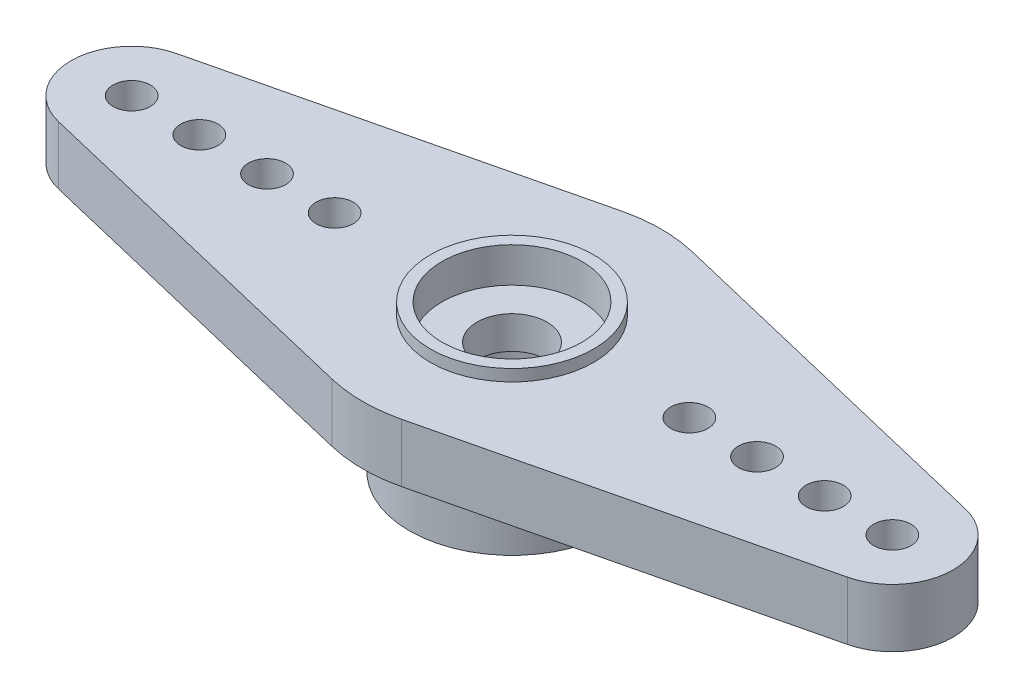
ISO-10303-21;
HEADER;
FILE_DESCRIPTION(('STEP AP214'),'2;1');
FILE_NAME('part.step','',(''),(''),'','','');
FILE_SCHEMA(('AUTOMOTIVE_DESIGN { 1 0 10303 214 1 1 1 1 }'));
ENDSEC;
DATA;
#1=APPLICATION_CONTEXT('core data for automotive mechanical design processes');
#2=APPLICATION_PROTOCOL_DEFINITION('international standard','automotive_design',2000,#1);
#3=PRODUCT_CONTEXT('',#1,'mechanical');
#4=PRODUCT('Part','Part','',(#3));
#5=PRODUCT_RELATED_PRODUCT_CATEGORY('part','',(#4));
#6=PRODUCT_DEFINITION_FORMATION('','',#4);
#7=PRODUCT_DEFINITION_CONTEXT('part definition',#1,'design');
#8=PRODUCT_DEFINITION('design','',#6,#7);
#9=PRODUCT_DEFINITION_SHAPE('','',#8);
#10=(LENGTH_UNIT() NAMED_UNIT(*) SI_UNIT(.MILLI.,.METRE.));
#11=(NAMED_UNIT(*) PLANE_ANGLE_UNIT() SI_UNIT($,.RADIAN.));
#12=(NAMED_UNIT(*) SI_UNIT($,.STERADIAN.) SOLID_ANGLE_UNIT());
#13=UNCERTAINTY_MEASURE_WITH_UNIT(LENGTH_MEASURE(1.E-05),#10,'distance_accuracy_value','');
#14=(GEOMETRIC_REPRESENTATION_CONTEXT(3) GLOBAL_UNCERTAINTY_ASSIGNED_CONTEXT((#13)) GLOBAL_UNIT_ASSIGNED_CONTEXT((#10,
#11,#12)) REPRESENTATION_CONTEXT('',''));
#15=CARTESIAN_POINT('',(0.,0.,0.));
#16=DIRECTION('',(0.,0.,1.));
#17=DIRECTION('',(1.,0.,0.));
#18=AXIS2_PLACEMENT_3D('',#15,#16,#17);
#19=CARTESIAN_POINT('',(0.,2.5,0.));
#20=DIRECTION('',(0.,-1.,0.));
#21=DIRECTION('',(0.,0.,-1.));
#22=AXIS2_PLACEMENT_3D('',#19,#20,#21);
#23=CYLINDRICAL_SURFACE('',#22,1.5);
#24=CARTESIAN_POINT('',(0.,0.0999999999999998,0.));
#25=DIRECTION('',(0.,-1.,0.));
#26=DIRECTION('',(0.,0.,-1.));
#27=AXIS2_PLACEMENT_3D('',#24,#25,#26);
#28=CIRCLE('',#27,1.5);
#29=CARTESIAN_POINT('',(0.,0.0999999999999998,-1.5));
#30=VERTEX_POINT('',#29);
#31=EDGE_CURVE('E39',#30,#30,#28,.T.);
#32=ORIENTED_EDGE('',*,*,#31,.T.);
#33=EDGE_LOOP('',(#32));
#34=FACE_BOUND('',#33,.T.);
#35=CARTESIAN_POINT('',(0.,1.5,0.));
#36=DIRECTION('',(0.,1.,0.));
#37=DIRECTION('',(0.,0.,1.));
#38=AXIS2_PLACEMENT_3D('',#35,#36,#37);
#39=CIRCLE('',#38,1.5);
#40=CARTESIAN_POINT('',(0.,1.5,1.5));
#41=VERTEX_POINT('',#40);
#42=EDGE_CURVE('E257',#41,#41,#39,.T.);
#43=ORIENTED_EDGE('',*,*,#42,.T.);
#44=EDGE_LOOP('',(#43));
#45=FACE_BOUND('',#44,.T.);
#46=ADVANCED_FACE('F35',(#34,#45),#23,.F.);
#47=CARTESIAN_POINT('',(0.,2.5,0.));
#48=DIRECTION('',(0.,1.,0.));
#49=DIRECTION('',(0.,0.,1.));
#50=AXIS2_PLACEMENT_3D('',#47,#48,#49);
#51=PLANE('',#50);
#52=CARTESIAN_POINT('',(7.6,2.5,0.));
#53=DIRECTION('',(0.,1.,0.));
#54=DIRECTION('',(0.,0.,1.));
#55=AXIS2_PLACEMENT_3D('',#52,#53,#54);
#56=CIRCLE('',#55,0.800000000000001);
#57=CARTESIAN_POINT('',(7.6,2.5,0.800000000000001));
#58=VERTEX_POINT('',#57);
#59=EDGE_CURVE('E222',#58,#58,#56,.T.);
#60=ORIENTED_EDGE('',*,*,#59,.F.);
#61=EDGE_LOOP('',(#60));
#62=FACE_BOUND('',#61,.T.);
#63=CARTESIAN_POINT('',(-13.4,2.5,0.));
#64=DIRECTION('',(0.,1.,0.));
#65=DIRECTION('',(0.,0.,1.));
#66=AXIS2_PLACEMENT_3D('',#63,#64,#65);
#67=CIRCLE('',#66,0.799999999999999);
#68=CARTESIAN_POINT('',(-13.4,2.5,0.799999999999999));
#69=VERTEX_POINT('',#68);
#70=EDGE_CURVE('E210',#69,#69,#67,.T.);
#71=ORIENTED_EDGE('',*,*,#70,.F.);
#72=EDGE_LOOP('',(#71));
#73=FACE_BOUND('',#72,.T.);
#74=CARTESIAN_POINT('',(10.5,2.5,0.));
#75=DIRECTION('',(0.,1.,0.));
#76=DIRECTION('',(0.,0.,1.));
#77=AXIS2_PLACEMENT_3D('',#74,#75,#76);
#78=CIRCLE('',#77,0.800000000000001);
#79=CARTESIAN_POINT('',(10.5,2.5,0.8));
#80=VERTEX_POINT('',#79);
#81=EDGE_CURVE('E198',#80,#80,#78,.T.);
#82=ORIENTED_EDGE('',*,*,#81,.F.);
#83=EDGE_LOOP('',(#82));
#84=FACE_BOUND('',#83,.T.);
#85=CARTESIAN_POINT('',(16.3,2.5,0.));
#86=DIRECTION('',(0.,1.,0.));
#87=DIRECTION('',(0.,0.,1.));
#88=AXIS2_PLACEMENT_3D('',#85,#86,#87);
#89=CIRCLE('',#88,0.799999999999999);
#90=CARTESIAN_POINT('',(16.3,2.5,0.8));
#91=VERTEX_POINT('',#90);
#92=EDGE_CURVE('E139',#91,#91,#89,.T.);
#93=ORIENTED_EDGE('',*,*,#92,.F.);
#94=EDGE_LOOP('',(#93));
#95=FACE_BOUND('',#94,.T.);
#96=CARTESIAN_POINT('',(0.,2.5,0.));
#97=DIRECTION('',(0.,1.,0.));
#98=DIRECTION('',(0.,0.,1.));
#99=AXIS2_PLACEMENT_3D('',#96,#97,#98);
#100=CIRCLE('',#99,6.4);
#101=CARTESIAN_POINT('',(-1.4920245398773,2.5,6.22365349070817));
#102=VERTEX_POINT('',#101);
#103=CARTESIAN_POINT('',(1.4920245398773,2.5,6.22365349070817));
#104=VERTEX_POINT('',#103);
#105=EDGE_CURVE('E150',#102,#104,#100,.T.);
#106=ORIENTED_EDGE('',*,*,#105,.T.);
#107=DIRECTION('',(0.972445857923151,0.,-0.233128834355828));
#108=VECTOR('',#107,1.);
#109=CARTESIAN_POINT('',(1.4920245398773,2.5,6.22365349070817));
#110=LINE('',#109,#108);
#111=CARTESIAN_POINT('',(16.9061349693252,2.5,2.52835923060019));
#112=VERTEX_POINT('',#111);
#113=EDGE_CURVE('E97',#104,#112,#110,.T.);
#114=ORIENTED_EDGE('',*,*,#113,.T.);
#115=CARTESIAN_POINT('',(16.3,2.5,0.));
#116=DIRECTION('',(0.,1.,0.));
#117=DIRECTION('',(0.,0.,1.));
#118=AXIS2_PLACEMENT_3D('',#115,#116,#117);
#119=CIRCLE('',#118,2.6);
#120=CARTESIAN_POINT('',(16.9061349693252,2.5,-2.52835923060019));
#121=VERTEX_POINT('',#120);
#122=EDGE_CURVE('E183',#112,#121,#119,.T.);
#123=ORIENTED_EDGE('',*,*,#122,.T.);
#124=DIRECTION('',(-0.972445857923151,0.,-0.233128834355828));
#125=VECTOR('',#124,1.);
#126=CARTESIAN_POINT('',(16.9061349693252,2.5,-2.52835923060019));
#127=LINE('',#126,#125);
#128=CARTESIAN_POINT('',(1.4920245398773,2.5,-6.22365349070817));
#129=VERTEX_POINT('',#128);
#130=EDGE_CURVE('E182',#121,#129,#127,.T.);
#131=ORIENTED_EDGE('',*,*,#130,.T.);
#132=CARTESIAN_POINT('',(0.,2.5,0.));
#133=DIRECTION('',(0.,1.,0.));
#134=DIRECTION('',(0.,0.,1.));
#135=AXIS2_PLACEMENT_3D('',#132,#133,#134);
#136=CIRCLE('',#135,6.4);
#137=CARTESIAN_POINT('',(-1.4920245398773,2.5,-6.22365349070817));
#138=VERTEX_POINT('',#137);
#139=EDGE_CURVE('E117',#129,#138,#136,.T.);
#140=ORIENTED_EDGE('',*,*,#139,.T.);
#141=DIRECTION('',(-0.972445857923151,0.,0.233128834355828));
#142=VECTOR('',#141,1.);
#143=CARTESIAN_POINT('',(-16.9061349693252,2.5,-2.5283592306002));
#144=LINE('',#143,#142);
#145=CARTESIAN_POINT('',(-16.9061349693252,2.5,-2.5283592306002));
#146=VERTEX_POINT('',#145);
#147=EDGE_CURVE('E110',#138,#146,#144,.T.);
#148=ORIENTED_EDGE('',*,*,#147,.T.);
#149=CARTESIAN_POINT('',(-16.3,2.5,0.));
#150=DIRECTION('',(0.,1.,0.));
#151=DIRECTION('',(0.,0.,1.));
#152=AXIS2_PLACEMENT_3D('',#149,#150,#151);
#153=CIRCLE('',#152,2.6);
#154=CARTESIAN_POINT('',(-16.9061349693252,2.5,2.52835923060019));
#155=VERTEX_POINT('',#154);
#156=EDGE_CURVE('E115',#146,#155,#153,.T.);
#157=ORIENTED_EDGE('',*,*,#156,.T.);
#158=DIRECTION('',(0.972445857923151,0.,0.233128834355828));
#159=VECTOR('',#158,1.);
#160=CARTESIAN_POINT('',(-1.4920245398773,2.5,6.22365349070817));
#161=LINE('',#160,#159);
#162=EDGE_CURVE('E53',#155,#102,#161,.T.);
#163=ORIENTED_EDGE('',*,*,#162,.T.);
#164=EDGE_LOOP('',(#106,#114,#123,#131,#140,#148,#157,#163));
#165=FACE_BOUND('',#164,.T.);
#166=CARTESIAN_POINT('',(13.4,2.5,0.));
#167=DIRECTION('',(0.,1.,0.));
#168=DIRECTION('',(0.,0.,1.));
#169=AXIS2_PLACEMENT_3D('',#166,#167,#168);
#170=CIRCLE('',#169,0.799999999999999);
#171=CARTESIAN_POINT('',(13.4,2.5,0.799999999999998));
#172=VERTEX_POINT('',#171);
#173=EDGE_CURVE('E192',#172,#172,#170,.T.);
#174=ORIENTED_EDGE('',*,*,#173,.F.);
#175=EDGE_LOOP('',(#174));
#176=FACE_BOUND('',#175,.T.);
#177=CARTESIAN_POINT('',(-16.3,2.5,0.));
#178=DIRECTION('',(0.,1.,0.));
#179=DIRECTION('',(0.,0.,1.));
#180=AXIS2_PLACEMENT_3D('',#177,#178,#179);
#181=CIRCLE('',#180,0.799999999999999);
#182=CARTESIAN_POINT('',(-16.3,2.5,0.799999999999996));
#183=VERTEX_POINT('',#182);
#184=EDGE_CURVE('E204',#183,#183,#181,.T.);
#185=ORIENTED_EDGE('',*,*,#184,.F.);
#186=EDGE_LOOP('',(#185));
#187=FACE_BOUND('',#186,.T.);
#188=CARTESIAN_POINT('',(-10.5,2.5,0.));
#189=DIRECTION('',(0.,1.,0.));
#190=DIRECTION('',(0.,0.,1.));
#191=AXIS2_PLACEMENT_3D('',#188,#189,#190);
#192=CIRCLE('',#191,0.800000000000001);
#193=CARTESIAN_POINT('',(-10.5,2.5,0.800000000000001));
#194=VERTEX_POINT('',#193);
#195=EDGE_CURVE('E216',#194,#194,#192,.T.);
#196=ORIENTED_EDGE('',*,*,#195,.F.);
#197=EDGE_LOOP('',(#196));
#198=FACE_BOUND('',#197,.T.);
#199=CARTESIAN_POINT('',(-7.6,2.5,0.));
#200=DIRECTION('',(0.,1.,0.));
#201=DIRECTION('',(0.,0.,1.));
#202=AXIS2_PLACEMENT_3D('',#199,#200,#201);
#203=CIRCLE('',#202,0.800000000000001);
#204=CARTESIAN_POINT('',(-7.6,2.5,0.800000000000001));
#205=VERTEX_POINT('',#204);
#206=EDGE_CURVE('E228',#205,#205,#203,.T.);
#207=ORIENTED_EDGE('',*,*,#206,.F.);
#208=EDGE_LOOP('',(#207));
#209=FACE_BOUND('',#208,.T.);
#210=CARTESIAN_POINT('',(0.,2.5,0.));
#211=DIRECTION('',(0.,1.,0.));
#212=DIRECTION('',(0.,0.,1.));
#213=AXIS2_PLACEMENT_3D('',#210,#211,#212);
#214=CIRCLE('',#213,3.5);
#215=CARTESIAN_POINT('',(0.,2.5,3.5));
#216=VERTEX_POINT('',#215);
#217=EDGE_CURVE('E246',#216,#216,#214,.T.);
#218=ORIENTED_EDGE('',*,*,#217,.F.);
#219=EDGE_LOOP('',(#218));
#220=FACE_BOUND('',#219,.T.);
#221=ADVANCED_FACE('F112',(#62,#73,#84,#95,#165,#176,#187,#198,#209,#220),#51,.T.);
#222=CARTESIAN_POINT('',(0.,0.,0.));
#223=DIRECTION('',(0.,1.,0.));
#224=DIRECTION('',(0.,0.,1.));
#225=AXIS2_PLACEMENT_3D('',#222,#223,#224);
#226=PLANE('',#225);
#227=CARTESIAN_POINT('',(-7.6,0.,0.));
#228=DIRECTION('',(0.,1.,0.));
#229=DIRECTION('',(0.,0.,1.));
#230=AXIS2_PLACEMENT_3D('',#227,#228,#229);
#231=CIRCLE('',#230,0.800000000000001);
#232=CARTESIAN_POINT('',(-7.6,0.,0.800000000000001));
#233=VERTEX_POINT('',#232);
#234=EDGE_CURVE('E231',#233,#233,#231,.T.);
#235=ORIENTED_EDGE('',*,*,#234,.T.);
#236=EDGE_LOOP('',(#235));
#237=FACE_BOUND('',#236,.T.);
#238=CARTESIAN_POINT('',(-10.5,0.,0.));
#239=DIRECTION('',(0.,1.,0.));
#240=DIRECTION('',(0.,0.,1.));
#241=AXIS2_PLACEMENT_3D('',#238,#239,#240);
#242=CIRCLE('',#241,0.800000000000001);
#243=CARTESIAN_POINT('',(-10.5,0.,0.800000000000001));
#244=VERTEX_POINT('',#243);
#245=EDGE_CURVE('E219',#244,#244,#242,.T.);
#246=ORIENTED_EDGE('',*,*,#245,.T.);
#247=EDGE_LOOP('',(#246));
#248=FACE_BOUND('',#247,.T.);
#249=CARTESIAN_POINT('',(-16.3,0.,0.));
#250=DIRECTION('',(0.,1.,0.));
#251=DIRECTION('',(0.,0.,1.));
#252=AXIS2_PLACEMENT_3D('',#249,#250,#251);
#253=CIRCLE('',#252,0.799999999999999);
#254=CARTESIAN_POINT('',(-16.3,0.,0.799999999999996));
#255=VERTEX_POINT('',#254);
#256=EDGE_CURVE('E207',#255,#255,#253,.T.);
#257=ORIENTED_EDGE('',*,*,#256,.T.);
#258=EDGE_LOOP('',(#257));
#259=FACE_BOUND('',#258,.T.);
#260=CARTESIAN_POINT('',(13.4,0.,0.));
#261=DIRECTION('',(0.,1.,0.));
#262=DIRECTION('',(0.,0.,1.));
#263=AXIS2_PLACEMENT_3D('',#260,#261,#262);
#264=CIRCLE('',#263,0.799999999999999);
#265=CARTESIAN_POINT('',(13.4,0.,0.799999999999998));
#266=VERTEX_POINT('',#265);
#267=EDGE_CURVE('E195',#266,#266,#264,.T.);
#268=ORIENTED_EDGE('',*,*,#267,.T.);
#269=EDGE_LOOP('',(#268));
#270=FACE_BOUND('',#269,.T.);
#271=CARTESIAN_POINT('',(0.,0.,0.));
#272=DIRECTION('',(0.,1.,0.));
#273=DIRECTION('',(0.,0.,1.));
#274=AXIS2_PLACEMENT_3D('',#271,#272,#273);
#275=CIRCLE('',#274,6.4);
#276=CARTESIAN_POINT('',(-1.4920245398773,0.,6.22365349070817));
#277=VERTEX_POINT('',#276);
#278=CARTESIAN_POINT('',(1.4920245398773,0.,6.22365349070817));
#279=VERTEX_POINT('',#278);
#280=EDGE_CURVE('E135',#277,#279,#275,.T.);
#281=ORIENTED_EDGE('',*,*,#280,.F.);
#282=DIRECTION('',(0.972445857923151,0.,0.233128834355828));
#283=VECTOR('',#282,1.);
#284=CARTESIAN_POINT('',(-1.4920245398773,0.,6.22365349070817));
#285=LINE('',#284,#283);
#286=CARTESIAN_POINT('',(-16.9061349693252,0.,2.52835923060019));
#287=VERTEX_POINT('',#286);
#288=EDGE_CURVE('E88',#287,#277,#285,.T.);
#289=ORIENTED_EDGE('',*,*,#288,.F.);
#290=CARTESIAN_POINT('',(-16.3,0.,0.));
#291=DIRECTION('',(0.,1.,0.));
#292=DIRECTION('',(0.,0.,1.));
#293=AXIS2_PLACEMENT_3D('',#290,#291,#292);
#294=CIRCLE('',#293,2.6);
#295=CARTESIAN_POINT('',(-16.9061349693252,0.,-2.5283592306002));
#296=VERTEX_POINT('',#295);
#297=EDGE_CURVE('E82',#296,#287,#294,.T.);
#298=ORIENTED_EDGE('',*,*,#297,.F.);
#299=DIRECTION('',(-0.972445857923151,0.,0.233128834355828));
#300=VECTOR('',#299,1.);
#301=CARTESIAN_POINT('',(-16.9061349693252,0.,-2.5283592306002));
#302=LINE('',#301,#300);
#303=CARTESIAN_POINT('',(-1.4920245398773,0.,-6.22365349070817));
#304=VERTEX_POINT('',#303);
#305=EDGE_CURVE('E125',#304,#296,#302,.T.);
#306=ORIENTED_EDGE('',*,*,#305,.F.);
#307=CARTESIAN_POINT('',(0.,0.,0.));
#308=DIRECTION('',(0.,1.,0.));
#309=DIRECTION('',(0.,0.,1.));
#310=AXIS2_PLACEMENT_3D('',#307,#308,#309);
#311=CIRCLE('',#310,6.4);
#312=CARTESIAN_POINT('',(1.4920245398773,0.,-6.22365349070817));
#313=VERTEX_POINT('',#312);
#314=EDGE_CURVE('E145',#313,#304,#311,.T.);
#315=ORIENTED_EDGE('',*,*,#314,.F.);
#316=DIRECTION('',(-0.972445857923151,0.,-0.233128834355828));
#317=VECTOR('',#316,1.);
#318=CARTESIAN_POINT('',(16.9061349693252,0.,-2.52835923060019));
#319=LINE('',#318,#317);
#320=CARTESIAN_POINT('',(16.9061349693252,0.,-2.52835923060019));
#321=VERTEX_POINT('',#320);
#322=EDGE_CURVE('E143',#321,#313,#319,.T.);
#323=ORIENTED_EDGE('',*,*,#322,.F.);
#324=CARTESIAN_POINT('',(16.3,0.,0.));
#325=DIRECTION('',(0.,1.,0.));
#326=DIRECTION('',(0.,0.,1.));
#327=AXIS2_PLACEMENT_3D('',#324,#325,#326);
#328=CIRCLE('',#327,2.6);
#329=CARTESIAN_POINT('',(16.9061349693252,0.,2.52835923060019));
#330=VERTEX_POINT('',#329);
#331=EDGE_CURVE('E141',#330,#321,#328,.T.);
#332=ORIENTED_EDGE('',*,*,#331,.F.);
#333=DIRECTION('',(0.972445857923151,0.,-0.233128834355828));
#334=VECTOR('',#333,1.);
#335=CARTESIAN_POINT('',(1.4920245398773,0.,6.22365349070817));
#336=LINE('',#335,#334);
#337=EDGE_CURVE('E138',#279,#330,#336,.T.);
#338=ORIENTED_EDGE('',*,*,#337,.F.);
#339=EDGE_LOOP('',(#281,#289,#298,#306,#315,#323,#332,#338));
#340=FACE_BOUND('',#339,.T.);
#341=CARTESIAN_POINT('',(16.3,0.,0.));
#342=DIRECTION('',(0.,1.,0.));
#343=DIRECTION('',(0.,0.,1.));
#344=AXIS2_PLACEMENT_3D('',#341,#342,#343);
#345=CIRCLE('',#344,0.799999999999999);
#346=CARTESIAN_POINT('',(16.3,0.,0.8));
#347=VERTEX_POINT('',#346);
#348=EDGE_CURVE('E189',#347,#347,#345,.T.);
#349=ORIENTED_EDGE('',*,*,#348,.T.);
#350=EDGE_LOOP('',(#349));
#351=FACE_BOUND('',#350,.T.);
#352=CARTESIAN_POINT('',(10.5,0.,0.));
#353=DIRECTION('',(0.,1.,0.));
#354=DIRECTION('',(0.,0.,1.));
#355=AXIS2_PLACEMENT_3D('',#352,#353,#354);
#356=CIRCLE('',#355,0.800000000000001);
#357=CARTESIAN_POINT('',(10.5,0.,0.8));
#358=VERTEX_POINT('',#357);
#359=EDGE_CURVE('E201',#358,#358,#356,.T.);
#360=ORIENTED_EDGE('',*,*,#359,.T.);
#361=EDGE_LOOP('',(#360));
#362=FACE_BOUND('',#361,.T.);
#363=CARTESIAN_POINT('',(-13.4,0.,0.));
#364=DIRECTION('',(0.,1.,0.));
#365=DIRECTION('',(0.,0.,1.));
#366=AXIS2_PLACEMENT_3D('',#363,#364,#365);
#367=CIRCLE('',#366,0.799999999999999);
#368=CARTESIAN_POINT('',(-13.4,0.,0.799999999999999));
#369=VERTEX_POINT('',#368);
#370=EDGE_CURVE('E213',#369,#369,#367,.T.);
#371=ORIENTED_EDGE('',*,*,#370,.T.);
#372=EDGE_LOOP('',(#371));
#373=FACE_BOUND('',#372,.T.);
#374=CARTESIAN_POINT('',(7.6,0.,0.));
#375=DIRECTION('',(0.,1.,0.));
#376=DIRECTION('',(0.,0.,1.));
#377=AXIS2_PLACEMENT_3D('',#374,#375,#376);
#378=CIRCLE('',#377,0.800000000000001);
#379=CARTESIAN_POINT('',(7.6,0.,0.800000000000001));
#380=VERTEX_POINT('',#379);
#381=EDGE_CURVE('E225',#380,#380,#378,.T.);
#382=ORIENTED_EDGE('',*,*,#381,.T.);
#383=EDGE_LOOP('',(#382));
#384=FACE_BOUND('',#383,.T.);
#385=CARTESIAN_POINT('',(0.,0.,0.));
#386=DIRECTION('',(0.,1.,0.));
#387=DIRECTION('',(0.,0.,1.));
#388=AXIS2_PLACEMENT_3D('',#385,#386,#387);
#389=CIRCLE('',#388,4.4);
#390=CARTESIAN_POINT('',(0.,0.,4.4));
#391=VERTEX_POINT('',#390);
#392=EDGE_CURVE('E11',#391,#391,#389,.F.);
#393=ORIENTED_EDGE('',*,*,#392,.F.);
#394=EDGE_LOOP('',(#393));
#395=FACE_BOUND('',#394,.T.);
#396=ADVANCED_FACE('F169',(#237,#248,#259,#270,#340,#351,#362,#373,#384,#395),#226,.F.);
#397=CARTESIAN_POINT('',(0.,2.5,0.));
#398=DIRECTION('',(0.,-1.,0.));
#399=DIRECTION('',(0.,0.,-1.));
#400=AXIS2_PLACEMENT_3D('',#397,#398,#399);
#401=CYLINDRICAL_SURFACE('',#400,6.4);
#402=ORIENTED_EDGE('',*,*,#280,.T.);
#403=DIRECTION('',(0.,-1.,0.));
#404=VECTOR('',#403,1.);
#405=CARTESIAN_POINT('',(1.4920245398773,2.5,6.22365349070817));
#406=LINE('',#405,#404);
#407=EDGE_CURVE('E45',#104,#279,#406,.T.);
#408=ORIENTED_EDGE('',*,*,#407,.F.);
#409=ORIENTED_EDGE('',*,*,#105,.F.);
#410=DIRECTION('',(0.,-1.,0.));
#411=VECTOR('',#410,1.);
#412=CARTESIAN_POINT('',(-1.4920245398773,2.5,6.22365349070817));
#413=LINE('',#412,#411);
#414=EDGE_CURVE('E131',#102,#277,#413,.T.);
#415=ORIENTED_EDGE('',*,*,#414,.T.);
#416=EDGE_LOOP('',(#402,#408,#409,#415));
#417=FACE_BOUND('',#416,.T.);
#418=ADVANCED_FACE('F37',(#417),#401,.T.);
#419=CARTESIAN_POINT('',(1.4920245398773,2.5,6.22365349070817));
#420=DIRECTION('',(-0.233128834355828,0.,-0.972445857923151));
#421=DIRECTION('',(-0.972445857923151,0.,0.233128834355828));
#422=AXIS2_PLACEMENT_3D('',#419,#420,#421);
#423=PLANE('',#422);
#424=ORIENTED_EDGE('',*,*,#337,.T.);
#425=DIRECTION('',(0.,-1.,0.));
#426=VECTOR('',#425,1.);
#427=CARTESIAN_POINT('',(16.9061349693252,2.5,2.52835923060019));
#428=LINE('',#427,#426);
#429=EDGE_CURVE('E160',#112,#330,#428,.T.);
#430=ORIENTED_EDGE('',*,*,#429,.F.);
#431=ORIENTED_EDGE('',*,*,#113,.F.);
#432=ORIENTED_EDGE('',*,*,#407,.T.);
#433=EDGE_LOOP('',(#424,#430,#431,#432));
#434=FACE_BOUND('',#433,.T.);
#435=ADVANCED_FACE('F164',(#434),#423,.F.);
#436=CARTESIAN_POINT('',(16.3,2.5,0.));
#437=DIRECTION('',(0.,-1.,0.));
#438=DIRECTION('',(0.,0.,-1.));
#439=AXIS2_PLACEMENT_3D('',#436,#437,#438);
#440=CYLINDRICAL_SURFACE('',#439,2.6);
#441=ORIENTED_EDGE('',*,*,#331,.T.);
#442=DIRECTION('',(0.,-1.,0.));
#443=VECTOR('',#442,1.);
#444=CARTESIAN_POINT('',(16.9061349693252,2.5,-2.52835923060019));
#445=LINE('',#444,#443);
#446=EDGE_CURVE('E157',#121,#321,#445,.T.);
#447=ORIENTED_EDGE('',*,*,#446,.F.);
#448=ORIENTED_EDGE('',*,*,#122,.F.);
#449=ORIENTED_EDGE('',*,*,#429,.T.);
#450=EDGE_LOOP('',(#441,#447,#448,#449));
#451=FACE_BOUND('',#450,.T.);
#452=ADVANCED_FACE('F176',(#451),#440,.T.);
#453=CARTESIAN_POINT('',(16.9061349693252,2.5,-2.52835923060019));
#454=DIRECTION('',(-0.233128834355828,0.,0.972445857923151));
#455=DIRECTION('',(0.972445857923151,0.,0.233128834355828));
#456=AXIS2_PLACEMENT_3D('',#453,#454,#455);
#457=PLANE('',#456);
#458=ORIENTED_EDGE('',*,*,#322,.T.);
#459=DIRECTION('',(0.,-1.,0.));
#460=VECTOR('',#459,1.);
#461=CARTESIAN_POINT('',(1.4920245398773,2.5,-6.22365349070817));
#462=LINE('',#461,#460);
#463=EDGE_CURVE('E154',#129,#313,#462,.T.);
#464=ORIENTED_EDGE('',*,*,#463,.F.);
#465=ORIENTED_EDGE('',*,*,#130,.F.);
#466=ORIENTED_EDGE('',*,*,#446,.T.);
#467=EDGE_LOOP('',(#458,#464,#465,#466));
#468=FACE_BOUND('',#467,.T.);
#469=ADVANCED_FACE('F180',(#468),#457,.F.);
#470=CARTESIAN_POINT('',(0.,2.5,0.));
#471=DIRECTION('',(0.,-1.,0.));
#472=DIRECTION('',(0.,0.,-1.));
#473=AXIS2_PLACEMENT_3D('',#470,#471,#472);
#474=CYLINDRICAL_SURFACE('',#473,6.4);
#475=ORIENTED_EDGE('',*,*,#314,.T.);
#476=DIRECTION('',(0.,-1.,0.));
#477=VECTOR('',#476,1.);
#478=CARTESIAN_POINT('',(-1.4920245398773,2.5,-6.22365349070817));
#479=LINE('',#478,#477);
#480=EDGE_CURVE('E126',#138,#304,#479,.T.);
#481=ORIENTED_EDGE('',*,*,#480,.F.);
#482=ORIENTED_EDGE('',*,*,#139,.F.);
#483=ORIENTED_EDGE('',*,*,#463,.T.);
#484=EDGE_LOOP('',(#475,#481,#482,#483));
#485=FACE_BOUND('',#484,.T.);
#486=ADVANCED_FACE('F303',(#485),#474,.T.);
#487=CARTESIAN_POINT('',(-16.9061349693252,2.5,-2.5283592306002));
#488=DIRECTION('',(0.233128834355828,0.,0.972445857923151));
#489=DIRECTION('',(0.972445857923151,0.,-0.233128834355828));
#490=AXIS2_PLACEMENT_3D('',#487,#488,#489);
#491=PLANE('',#490);
#492=ORIENTED_EDGE('',*,*,#305,.T.);
#493=DIRECTION('',(0.,-1.,0.));
#494=VECTOR('',#493,1.);
#495=CARTESIAN_POINT('',(-16.9061349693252,2.5,-2.5283592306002));
#496=LINE('',#495,#494);
#497=EDGE_CURVE('E122',#146,#296,#496,.T.);
#498=ORIENTED_EDGE('',*,*,#497,.F.);
#499=ORIENTED_EDGE('',*,*,#147,.F.);
#500=ORIENTED_EDGE('',*,*,#480,.T.);
#501=EDGE_LOOP('',(#492,#498,#499,#500));
#502=FACE_BOUND('',#501,.T.);
#503=ADVANCED_FACE('F123',(#502),#491,.F.);
#504=CARTESIAN_POINT('',(-16.3,2.5,0.));
#505=DIRECTION('',(0.,-1.,0.));
#506=DIRECTION('',(0.,0.,-1.));
#507=AXIS2_PLACEMENT_3D('',#504,#505,#506);
#508=CYLINDRICAL_SURFACE('',#507,2.6);
#509=ORIENTED_EDGE('',*,*,#297,.T.);
#510=DIRECTION('',(0.,-1.,0.));
#511=VECTOR('',#510,1.);
#512=CARTESIAN_POINT('',(-16.9061349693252,2.5,2.52835923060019));
#513=LINE('',#512,#511);
#514=EDGE_CURVE('E127',#155,#287,#513,.T.);
#515=ORIENTED_EDGE('',*,*,#514,.F.);
#516=ORIENTED_EDGE('',*,*,#156,.F.);
#517=ORIENTED_EDGE('',*,*,#497,.T.);
#518=EDGE_LOOP('',(#509,#515,#516,#517));
#519=FACE_BOUND('',#518,.T.);
#520=ADVANCED_FACE('F129',(#519),#508,.T.);
#521=CARTESIAN_POINT('',(-1.4920245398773,2.5,6.22365349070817));
#522=DIRECTION('',(0.233128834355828,0.,-0.972445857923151));
#523=DIRECTION('',(-0.972445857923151,0.,-0.233128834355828));
#524=AXIS2_PLACEMENT_3D('',#521,#522,#523);
#525=PLANE('',#524);
#526=ORIENTED_EDGE('',*,*,#288,.T.);
#527=ORIENTED_EDGE('',*,*,#414,.F.);
#528=ORIENTED_EDGE('',*,*,#162,.F.);
#529=ORIENTED_EDGE('',*,*,#514,.T.);
#530=EDGE_LOOP('',(#526,#527,#528,#529));
#531=FACE_BOUND('',#530,.T.);
#532=ADVANCED_FACE('F296',(#531),#525,.F.);
#533=CARTESIAN_POINT('',(16.3,2.5,0.));
#534=DIRECTION('',(0.,-1.,0.));
#535=DIRECTION('',(0.,0.,-1.));
#536=AXIS2_PLACEMENT_3D('',#533,#534,#535);
#537=CYLINDRICAL_SURFACE('',#536,0.799999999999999);
#538=ORIENTED_EDGE('',*,*,#92,.T.);
#539=EDGE_LOOP('',(#538));
#540=FACE_BOUND('',#539,.T.);
#541=ORIENTED_EDGE('',*,*,#348,.F.);
#542=EDGE_LOOP('',(#541));
#543=FACE_BOUND('',#542,.T.);
#544=ADVANCED_FACE('F290',(#540,#543),#537,.F.);
#545=CARTESIAN_POINT('',(13.4,2.5,0.));
#546=DIRECTION('',(0.,-1.,0.));
#547=DIRECTION('',(0.,0.,-1.));
#548=AXIS2_PLACEMENT_3D('',#545,#546,#547);
#549=CYLINDRICAL_SURFACE('',#548,0.799999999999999);
#550=ORIENTED_EDGE('',*,*,#173,.T.);
#551=EDGE_LOOP('',(#550));
#552=FACE_BOUND('',#551,.T.);
#553=ORIENTED_EDGE('',*,*,#267,.F.);
#554=EDGE_LOOP('',(#553));
#555=FACE_BOUND('',#554,.T.);
#556=ADVANCED_FACE('F436',(#552,#555),#549,.F.);
#557=CARTESIAN_POINT('',(10.5,2.5,0.));
#558=DIRECTION('',(0.,-1.,0.));
#559=DIRECTION('',(0.,0.,-1.));
#560=AXIS2_PLACEMENT_3D('',#557,#558,#559);
#561=CYLINDRICAL_SURFACE('',#560,0.800000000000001);
#562=ORIENTED_EDGE('',*,*,#81,.T.);
#563=EDGE_LOOP('',(#562));
#564=FACE_BOUND('',#563,.T.);
#565=ORIENTED_EDGE('',*,*,#359,.F.);
#566=EDGE_LOOP('',(#565));
#567=FACE_BOUND('',#566,.T.);
#568=ADVANCED_FACE('F428',(#564,#567),#561,.F.);
#569=CARTESIAN_POINT('',(-16.3,2.5,0.));
#570=DIRECTION('',(0.,-1.,0.));
#571=DIRECTION('',(0.,0.,-1.));
#572=AXIS2_PLACEMENT_3D('',#569,#570,#571);
#573=CYLINDRICAL_SURFACE('',#572,0.799999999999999);
#574=ORIENTED_EDGE('',*,*,#184,.T.);
#575=EDGE_LOOP('',(#574));
#576=FACE_BOUND('',#575,.T.);
#577=ORIENTED_EDGE('',*,*,#256,.F.);
#578=EDGE_LOOP('',(#577));
#579=FACE_BOUND('',#578,.T.);
#580=ADVANCED_FACE('F420',(#576,#579),#573,.F.);
#581=CARTESIAN_POINT('',(-13.4,2.5,0.));
#582=DIRECTION('',(0.,-1.,0.));
#583=DIRECTION('',(0.,0.,-1.));
#584=AXIS2_PLACEMENT_3D('',#581,#582,#583);
#585=CYLINDRICAL_SURFACE('',#584,0.799999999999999);
#586=ORIENTED_EDGE('',*,*,#70,.T.);
#587=EDGE_LOOP('',(#586));
#588=FACE_BOUND('',#587,.T.);
#589=ORIENTED_EDGE('',*,*,#370,.F.);
#590=EDGE_LOOP('',(#589));
#591=FACE_BOUND('',#590,.T.);
#592=ADVANCED_FACE('F412',(#588,#591),#585,.F.);
#593=CARTESIAN_POINT('',(-10.5,2.5,0.));
#594=DIRECTION('',(0.,-1.,0.));
#595=DIRECTION('',(0.,0.,-1.));
#596=AXIS2_PLACEMENT_3D('',#593,#594,#595);
#597=CYLINDRICAL_SURFACE('',#596,0.800000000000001);
#598=ORIENTED_EDGE('',*,*,#195,.T.);
#599=EDGE_LOOP('',(#598));
#600=FACE_BOUND('',#599,.T.);
#601=ORIENTED_EDGE('',*,*,#245,.F.);
#602=EDGE_LOOP('',(#601));
#603=FACE_BOUND('',#602,.T.);
#604=ADVANCED_FACE('F404',(#600,#603),#597,.F.);
#605=CARTESIAN_POINT('',(7.6,2.5,0.));
#606=DIRECTION('',(0.,-1.,0.));
#607=DIRECTION('',(0.,0.,-1.));
#608=AXIS2_PLACEMENT_3D('',#605,#606,#607);
#609=CYLINDRICAL_SURFACE('',#608,0.800000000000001);
#610=ORIENTED_EDGE('',*,*,#59,.T.);
#611=EDGE_LOOP('',(#610));
#612=FACE_BOUND('',#611,.T.);
#613=ORIENTED_EDGE('',*,*,#381,.F.);
#614=EDGE_LOOP('',(#613));
#615=FACE_BOUND('',#614,.T.);
#616=ADVANCED_FACE('F396',(#612,#615),#609,.F.);
#617=CARTESIAN_POINT('',(-7.6,2.5,0.));
#618=DIRECTION('',(0.,-1.,0.));
#619=DIRECTION('',(0.,0.,-1.));
#620=AXIS2_PLACEMENT_3D('',#617,#618,#619);
#621=CYLINDRICAL_SURFACE('',#620,0.800000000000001);
#622=ORIENTED_EDGE('',*,*,#206,.T.);
#623=EDGE_LOOP('',(#622));
#624=FACE_BOUND('',#623,.T.);
#625=ORIENTED_EDGE('',*,*,#234,.F.);
#626=EDGE_LOOP('',(#625));
#627=FACE_BOUND('',#626,.T.);
#628=ADVANCED_FACE('F389',(#624,#627),#621,.F.);
#629=CARTESIAN_POINT('',(0.,-3.3,0.));
#630=DIRECTION('',(0.,1.,0.));
#631=DIRECTION('',(0.,0.,1.));
#632=AXIS2_PLACEMENT_3D('',#629,#630,#631);
#633=CYLINDRICAL_SURFACE('',#632,4.4);
#634=CARTESIAN_POINT('',(0.,-3.3,0.));
#635=DIRECTION('',(0.,-1.,0.));
#636=DIRECTION('',(0.,0.,-1.));
#637=AXIS2_PLACEMENT_3D('',#634,#635,#636);
#638=CIRCLE('',#637,4.4);
#639=CARTESIAN_POINT('',(0.,-3.3,-4.4));
#640=VERTEX_POINT('',#639);
#641=EDGE_CURVE('E234',#640,#640,#638,.T.);
#642=ORIENTED_EDGE('',*,*,#641,.F.);
#643=EDGE_LOOP('',(#642));
#644=FACE_BOUND('',#643,.T.);
#645=ORIENTED_EDGE('',*,*,#392,.T.);
#646=EDGE_LOOP('',(#645));
#647=FACE_BOUND('',#646,.T.);
#648=ADVANCED_FACE('F382',(#644,#647),#633,.T.);
#649=CARTESIAN_POINT('',(0.,-3.3,0.));
#650=DIRECTION('',(0.,-1.,0.));
#651=DIRECTION('',(0.,0.,-1.));
#652=AXIS2_PLACEMENT_3D('',#649,#650,#651);
#653=PLANE('',#652);
#654=CARTESIAN_POINT('',(0.,-3.3,0.));
#655=DIRECTION('',(0.,-1.,0.));
#656=DIRECTION('',(0.,0.,-1.));
#657=AXIS2_PLACEMENT_3D('',#654,#655,#656);
#658=CIRCLE('',#657,3.);
#659=CARTESIAN_POINT('',(0.,-3.3,-3.));
#660=VERTEX_POINT('',#659);
#661=EDGE_CURVE('E239',#660,#660,#658,.T.);
#662=ORIENTED_EDGE('',*,*,#661,.F.);
#663=EDGE_LOOP('',(#662));
#664=FACE_BOUND('',#663,.T.);
#665=ORIENTED_EDGE('',*,*,#641,.T.);
#666=EDGE_LOOP('',(#665));
#667=FACE_BOUND('',#666,.T.);
#668=ADVANCED_FACE('F374',(#664,#667),#653,.T.);
#669=CARTESIAN_POINT('',(0.,0.0999999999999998,0.));
#670=DIRECTION('',(0.,-1.,0.));
#671=DIRECTION('',(0.,0.,-1.));
#672=AXIS2_PLACEMENT_3D('',#669,#670,#671);
#673=CYLINDRICAL_SURFACE('',#672,3.);
#674=CARTESIAN_POINT('',(0.,0.0999999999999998,0.));
#675=DIRECTION('',(0.,-1.,0.));
#676=DIRECTION('',(0.,0.,-1.));
#677=AXIS2_PLACEMENT_3D('',#674,#675,#676);
#678=CIRCLE('',#677,3.);
#679=CARTESIAN_POINT('',(0.,0.0999999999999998,-3.));
#680=VERTEX_POINT('',#679);
#681=EDGE_CURVE('E242',#680,#680,#678,.T.);
#682=ORIENTED_EDGE('',*,*,#681,.F.);
#683=EDGE_LOOP('',(#682));
#684=FACE_BOUND('',#683,.T.);
#685=ORIENTED_EDGE('',*,*,#661,.T.);
#686=EDGE_LOOP('',(#685));
#687=FACE_BOUND('',#686,.T.);
#688=ADVANCED_FACE('F369',(#684,#687),#673,.F.);
#689=CARTESIAN_POINT('',(0.,0.0999999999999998,0.));
#690=DIRECTION('',(0.,-1.,0.));
#691=DIRECTION('',(0.,0.,-1.));
#692=AXIS2_PLACEMENT_3D('',#689,#690,#691);
#693=PLANE('',#692);
#694=ORIENTED_EDGE('',*,*,#31,.F.);
#695=EDGE_LOOP('',(#694));
#696=FACE_BOUND('',#695,.T.);
#697=ORIENTED_EDGE('',*,*,#681,.T.);
#698=EDGE_LOOP('',(#697));
#699=FACE_BOUND('',#698,.T.);
#700=ADVANCED_FACE('F334',(#696,#699),#693,.T.);
#701=CARTESIAN_POINT('',(0.,3.,0.));
#702=DIRECTION('',(0.,1.,0.));
#703=DIRECTION('',(0.,0.,1.));
#704=AXIS2_PLACEMENT_3D('',#701,#702,#703);
#705=PLANE('',#704);
#706=CARTESIAN_POINT('',(0.,3.,0.));
#707=DIRECTION('',(0.,1.,0.));
#708=DIRECTION('',(0.,0.,1.));
#709=AXIS2_PLACEMENT_3D('',#706,#707,#708);
#710=CIRCLE('',#709,3.5);
#711=CARTESIAN_POINT('',(0.,3.,3.5));
#712=VERTEX_POINT('',#711);
#713=EDGE_CURVE('E243',#712,#712,#710,.T.);
#714=ORIENTED_EDGE('',*,*,#713,.T.);
#715=EDGE_LOOP('',(#714));
#716=FACE_BOUND('',#715,.T.);
#717=CARTESIAN_POINT('',(0.,3.,0.));
#718=DIRECTION('',(0.,1.,0.));
#719=DIRECTION('',(0.,0.,1.));
#720=AXIS2_PLACEMENT_3D('',#717,#718,#719);
#721=CIRCLE('',#720,3.);
#722=CARTESIAN_POINT('',(0.,3.,3.));
#723=VERTEX_POINT('',#722);
#724=EDGE_CURVE('E249',#723,#723,#721,.T.);
#725=ORIENTED_EDGE('',*,*,#724,.F.);
#726=EDGE_LOOP('',(#725));
#727=FACE_BOUND('',#726,.T.);
#728=ADVANCED_FACE('F276',(#716,#727),#705,.T.);
#729=CARTESIAN_POINT('',(0.,3.,0.));
#730=DIRECTION('',(0.,-1.,0.));
#731=DIRECTION('',(0.,0.,-1.));
#732=AXIS2_PLACEMENT_3D('',#729,#730,#731);
#733=CYLINDRICAL_SURFACE('',#732,3.5);
#734=ORIENTED_EDGE('',*,*,#713,.F.);
#735=EDGE_LOOP('',(#734));
#736=FACE_BOUND('',#735,.T.);
#737=ORIENTED_EDGE('',*,*,#217,.T.);
#738=EDGE_LOOP('',(#737));
#739=FACE_BOUND('',#738,.T.);
#740=ADVANCED_FACE('F270',(#736,#739),#733,.T.);
#741=CARTESIAN_POINT('',(0.,3.,0.));
#742=DIRECTION('',(0.,-1.,0.));
#743=DIRECTION('',(0.,0.,-1.));
#744=AXIS2_PLACEMENT_3D('',#741,#742,#743);
#745=CYLINDRICAL_SURFACE('',#744,3.);
#746=ORIENTED_EDGE('',*,*,#724,.T.);
#747=EDGE_LOOP('',(#746));
#748=FACE_BOUND('',#747,.T.);
#749=CARTESIAN_POINT('',(0.,1.5,0.));
#750=DIRECTION('',(0.,1.,0.));
#751=DIRECTION('',(0.,0.,1.));
#752=AXIS2_PLACEMENT_3D('',#749,#750,#751);
#753=CIRCLE('',#752,3.);
#754=CARTESIAN_POINT('',(0.,1.5,3.));
#755=VERTEX_POINT('',#754);
#756=EDGE_CURVE('E254',#755,#755,#753,.T.);
#757=ORIENTED_EDGE('',*,*,#756,.F.);
#758=EDGE_LOOP('',(#757));
#759=FACE_BOUND('',#758,.T.);
#760=ADVANCED_FACE('F265',(#748,#759),#745,.F.);
#761=CARTESIAN_POINT('',(0.,1.5,0.));
#762=DIRECTION('',(0.,1.,0.));
#763=DIRECTION('',(0.,0.,1.));
#764=AXIS2_PLACEMENT_3D('',#761,#762,#763);
#765=PLANE('',#764);
#766=ORIENTED_EDGE('',*,*,#42,.F.);
#767=EDGE_LOOP('',(#766));
#768=FACE_BOUND('',#767,.T.);
#769=ORIENTED_EDGE('',*,*,#756,.T.);
#770=EDGE_LOOP('',(#769));
#771=FACE_BOUND('',#770,.T.);
#772=ADVANCED_FACE('F262',(#768,#771),#765,.T.);
#773=CLOSED_SHELL('',(#46,#221,#396,#418,#435,#452,#469,#486,#503,#520,#532,#544,#556,#568,#580,
#592,#604,#616,#628,#648,#668,#688,#700,#728,#740,#760,#772));
#774=MANIFOLD_SOLID_BREP('B2',#773);
#775=ADVANCED_BREP_SHAPE_REPRESENTATION('',(#18,#774),#14);
#776=SHAPE_DEFINITION_REPRESENTATION(#9,#775);
ENDSEC;
END-ISO-10303-21;
